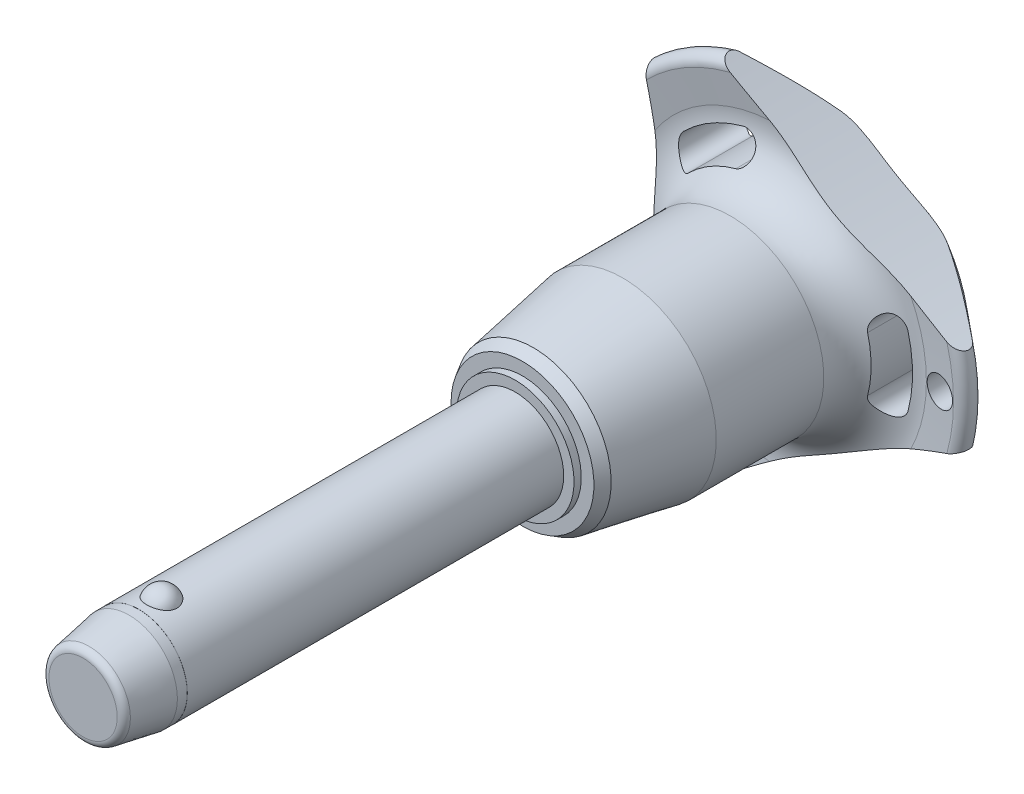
from build123d import *

# Parameters (mm, degrees)
SKETCH1_R           = 5
BOSS_EXTRUDE1_DEPTH = 35
SKETCH2_R           = 4.25
BOSS_EXTRUDE2_DEPTH = 33.3
BOSS_EXTRUDE3_START = 9.6
SKETCH1_2_R         = 5
BOSS_EXTRUDE3_DEPTH = 9.6
CHAMFER1_SIZE       = 4.8
CHAMFER1_SIZE2      = 0.846369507
FILLET1_R           = 0.75
SKETCH6_R           = 102.8
CUT_EXTRUDE1_DEPTH  = 74.713650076
CIRPATTERN1_COUNT   = 3
SKETCH7_R           = 1.5
CUT_EXTRUDE2_DEPTH  = 74.493908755
SKETCH8_R           = 5
SKETCH8_R_2         = 4.99
CUT_EXTRUDE3_DEPTH  = 5.76


with BuildPart() as part:
    # Sketch1 → Boss-Extrude1 (new body)
    with BuildSketch(Plane.XY):
        Circle(SKETCH1_R)
    extrude(amount=-BOSS_EXTRUDE1_DEPTH)

    # Sketch2 → Boss-Extrude2 (add)
    with BuildSketch(Plane(origin=(0, 0, -35), x_dir=(-1, 0, 0), z_dir=(0, 0, -1))):
        Circle(SKETCH2_R)
    extrude(amount=BOSS_EXTRUDE2_DEPTH)

    # Sketch3 → Revolve1 (revolve)
    with BuildSketch(Plane(origin=(0, 0, 0), x_dir=(0, 0, -1), z_dir=(1, 0, 0))):
        with BuildLine():
            Line((-1.516575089, 6), (-1.516575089, 2.7))
            ThreePointArc((-1.516575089, 2.7), (0.133424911, 4.35), (-1.516575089, 6))
        make_face()
        with BuildLine():
            Line((-1.516575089, -2.7), (-1.516575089, -6))
            ThreePointArc((-1.516575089, -6), (0.133424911, -4.35), (-1.516575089, -2.7))
        make_face()
    revolve(axis=Axis((0, -2.7, 1.516575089), (0, 1, 0)))

    # Sketch1_2 → Boss-Extrude3 (add)
    with BuildSketch(Plane.XY.offset(BOSS_EXTRUDE3_START)):
        Circle(SKETCH1_2_R)
    extrude(amount=-BOSS_EXTRUDE3_DEPTH)

    # Chamfer1
    chamfer1_edges = [part.edges().sort_by_distance(p)[0] for p in [
        (-5, 0, 9.6),
    ]]
    chamfer1_side = [part.faces().sort_by_distance(p)[0] for p in [
        (-5, 0, -12.7),
    ]]
    chamfer(chamfer1_edges, length=CHAMFER1_SIZE, length2=CHAMFER1_SIZE2, reference=chamfer1_side[0])

    # Fillet1
    fillet1_edges = [part.edges().sort_by_distance(p)[0] for p in [
        (-4.153630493, 0, 9.6),
        (4.25, 0, -68.3),
    ]]
    fillet(fillet1_edges, radius=FILLET1_R)

    # Sketch4 → Revolve2 (revolve)
    with BuildSketch(Plane(origin=(0, 0, 0), x_dir=(0, 0, -1), z_dir=(1, 0, 0)), mode=Mode.PRIVATE) as revolve2_sk:
        Polygon((35, 0), (35, 6.067402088), (35.75, 6.067402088), (35.75, 7.371950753), (36.879772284, 8.024225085), (46.1, 9.65), (57.2, 9.65), (57.2, 0), align=None)
    revolve(revolve2_sk.sketch.rotate(Axis((0, 0, -57.2), (0, 0, 1)), 90), axis=Axis((0, 0, -57.2), (0, 0, 1)))

    # Sketch5 → Revolve3 (revolve)
    with BuildSketch(Plane(origin=(0, 0, 0), x_dir=(0, 0, -1), z_dir=(1, 0, 0)), mode=Mode.PRIVATE) as revolve3_sk:
        with BuildLine():
            Line((62.16082631, 15.274661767), (61.757834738, 18.475067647))
            ThreePointArc((61.757834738, 18.475067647), (62.349836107, 19.516443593), (63.516044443, 19.24278761))
            Line((63.516044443, 19.24278761), (67.835691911, 14.094832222))
            ThreePointArc((67.835691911, 14.094832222), (68.3, 12.689260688), (67.67067517, 11.349423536))
            ThreePointArc((67.67067517, 11.349423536), (64.033110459, 6.185112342), (62.75, 0))
            Line((62.75, 0), (57.2, 0))
            Line((57.2, 0), (57.2, 9.65))
            ThreePointArc((57.2, 9.65), (60.949887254, 11.342683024), (62.16082631, 15.274661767))
        make_face()
    revolve(revolve3_sk.sketch.rotate(Axis((0, 0, -62.75), (0, 0, 1)), 90), axis=Axis((0, 0, -62.75), (0, 0, 1)))

    # Sketch6 → Cut-Extrude1 (cut, through all)
    with BuildSketch(Plane.XY):
        with Locations((-115.2, 0)):
            Circle(SKETCH6_R)
        with BuildLine():
            ThreePointArc((13.411913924, -3.529271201), (13.868496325, 0), (13.411913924, 3.529271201))
            ThreePointArc((13.411913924, 3.529271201), (11.694200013, 4.531299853), (10.692171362, 2.813585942))
            ThreePointArc((10.692171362, 2.813585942), (11.056165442, 0), (10.692171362, -2.813585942))
            ThreePointArc((10.692171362, -2.813585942), (11.694200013, -4.531299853), (13.411913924, -3.529271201))
        make_face()
    cut_extrude1 = extrude(amount=-CUT_EXTRUDE1_DEPTH, mode=Mode.SUBTRACT)

    # CirPattern1: Cut-Extrude1 ×3 about axis
    cirpattern1_axis = Axis((0, 0, 0), (0, 0, 1))
    for i in range(1, CIRPATTERN1_COUNT):
        add(cut_extrude1.rotate(cirpattern1_axis, i * 360 / CIRPATTERN1_COUNT), mode=Mode.SUBTRACT)

    # Sketch7 → Cut-Extrude2 (cut, through all)
    with BuildSketch(Plane.XY):
        with Locations(Location((16.868496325, 0, 0), (0, 0, 225.467095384))):
            Circle(SKETCH7_R)
    extrude(amount=-CUT_EXTRUDE2_DEPTH, mode=Mode.SUBTRACT)

    # Sketch8 → Cut-Extrude3 (cut)
    with BuildSketch(Plane.XY.offset(9.6)):
        Circle(SKETCH8_R)
        Circle(SKETCH8_R_2, mode=Mode.SUBTRACT)
    extrude(amount=-CUT_EXTRUDE3_DEPTH, mode=Mode.SUBTRACT)


solid = part.part
